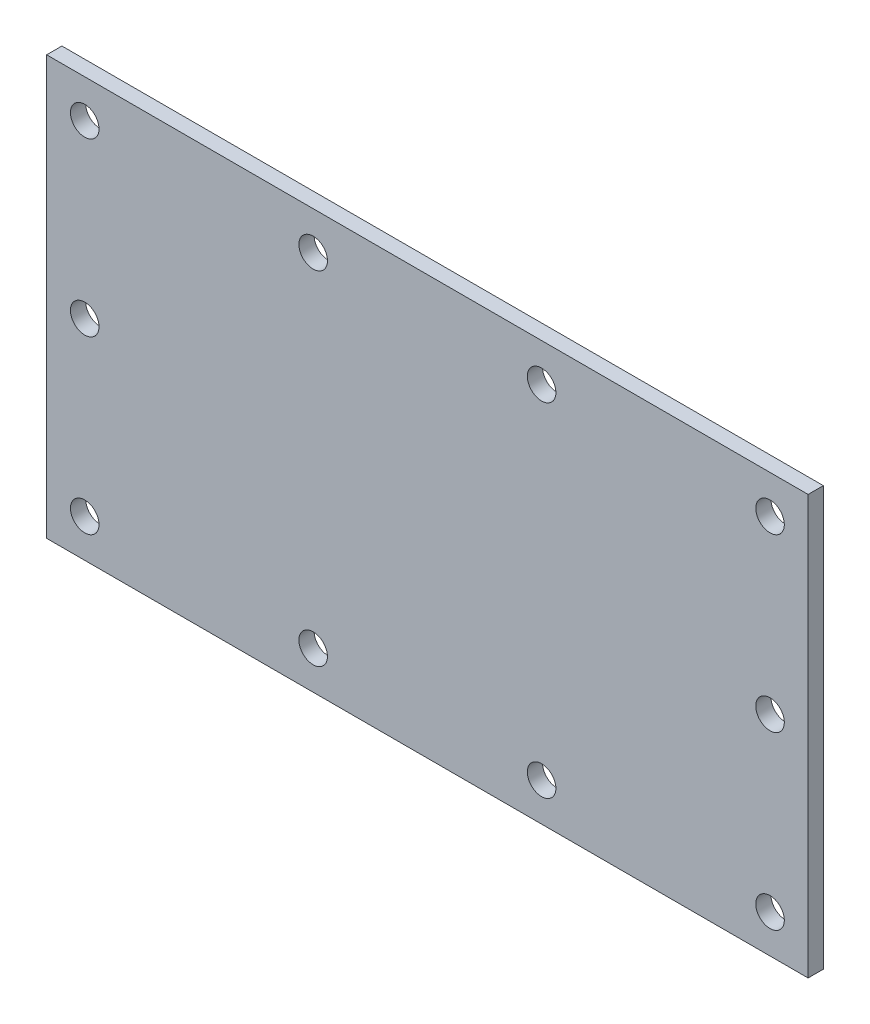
ISO-10303-21;
HEADER;
FILE_DESCRIPTION(('STEP AP214'),'2;1');
FILE_NAME('part.step','',(''),(''),'','','');
FILE_SCHEMA(('AUTOMOTIVE_DESIGN { 1 0 10303 214 1 1 1 1 }'));
ENDSEC;
DATA;
#1=APPLICATION_CONTEXT('core data for automotive mechanical design processes');
#2=APPLICATION_PROTOCOL_DEFINITION('international standard','automotive_design',2000,#1);
#3=PRODUCT_CONTEXT('',#1,'mechanical');
#4=PRODUCT('Part','Part','',(#3));
#5=PRODUCT_RELATED_PRODUCT_CATEGORY('part','',(#4));
#6=PRODUCT_DEFINITION_FORMATION('','',#4);
#7=PRODUCT_DEFINITION_CONTEXT('part definition',#1,'design');
#8=PRODUCT_DEFINITION('design','',#6,#7);
#9=PRODUCT_DEFINITION_SHAPE('','',#8);
#10=(LENGTH_UNIT() NAMED_UNIT(*) SI_UNIT(.MILLI.,.METRE.));
#11=(NAMED_UNIT(*) PLANE_ANGLE_UNIT() SI_UNIT($,.RADIAN.));
#12=(NAMED_UNIT(*) SI_UNIT($,.STERADIAN.) SOLID_ANGLE_UNIT());
#13=UNCERTAINTY_MEASURE_WITH_UNIT(LENGTH_MEASURE(1.E-05),#10,'distance_accuracy_value','');
#14=(GEOMETRIC_REPRESENTATION_CONTEXT(3) GLOBAL_UNCERTAINTY_ASSIGNED_CONTEXT((#13)) GLOBAL_UNIT_ASSIGNED_CONTEXT((#10,
#11,#12)) REPRESENTATION_CONTEXT('',''));
#15=CARTESIAN_POINT('',(0.,0.,0.));
#16=DIRECTION('',(0.,0.,1.));
#17=DIRECTION('',(1.,0.,0.));
#18=AXIS2_PLACEMENT_3D('',#15,#16,#17);
#19=CARTESIAN_POINT('',(0.,-220.,8.));
#20=DIRECTION('',(0.,0.,1.));
#21=DIRECTION('',(1.,0.,0.));
#22=AXIS2_PLACEMENT_3D('',#19,#20,#21);
#23=PLANE('',#22);
#24=CARTESIAN_POINT('',(140.,-20.,8.));
#25=DIRECTION('',(0.,0.,1.));
#26=DIRECTION('',(1.,0.,0.));
#27=AXIS2_PLACEMENT_3D('',#24,#25,#26);
#28=CIRCLE('',#27,7.50000000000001);
#29=CARTESIAN_POINT('',(147.5,-20.,8.));
#30=VERTEX_POINT('',#29);
#31=EDGE_CURVE('E139',#30,#30,#28,.T.);
#32=ORIENTED_EDGE('',*,*,#31,.F.);
#33=EDGE_LOOP('',(#32));
#34=FACE_BOUND('',#33,.T.);
#35=CARTESIAN_POINT('',(20.,-110.,8.));
#36=DIRECTION('',(0.,0.,1.));
#37=DIRECTION('',(1.,0.,0.));
#38=AXIS2_PLACEMENT_3D('',#35,#36,#37);
#39=CIRCLE('',#38,7.50000000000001);
#40=CARTESIAN_POINT('',(27.5,-110.,8.));
#41=VERTEX_POINT('',#40);
#42=EDGE_CURVE('E153',#41,#41,#39,.T.);
#43=ORIENTED_EDGE('',*,*,#42,.F.);
#44=EDGE_LOOP('',(#43));
#45=FACE_BOUND('',#44,.T.);
#46=CARTESIAN_POINT('',(140.,-200.,8.));
#47=DIRECTION('',(0.,0.,1.));
#48=DIRECTION('',(1.,0.,0.));
#49=AXIS2_PLACEMENT_3D('',#46,#47,#48);
#50=CIRCLE('',#49,7.50000000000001);
#51=CARTESIAN_POINT('',(147.5,-200.,8.));
#52=VERTEX_POINT('',#51);
#53=EDGE_CURVE('E163',#52,#52,#50,.T.);
#54=ORIENTED_EDGE('',*,*,#53,.F.);
#55=EDGE_LOOP('',(#54));
#56=FACE_BOUND('',#55,.T.);
#57=CARTESIAN_POINT('',(380.,-200.,8.));
#58=DIRECTION('',(0.,0.,1.));
#59=DIRECTION('',(1.,0.,0.));
#60=AXIS2_PLACEMENT_3D('',#57,#58,#59);
#61=CIRCLE('',#60,7.50000000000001);
#62=CARTESIAN_POINT('',(387.5,-200.,8.));
#63=VERTEX_POINT('',#62);
#64=EDGE_CURVE('E173',#63,#63,#61,.T.);
#65=ORIENTED_EDGE('',*,*,#64,.F.);
#66=EDGE_LOOP('',(#65));
#67=FACE_BOUND('',#66,.T.);
#68=CARTESIAN_POINT('',(380.,-20.,8.));
#69=DIRECTION('',(0.,0.,1.));
#70=DIRECTION('',(1.,0.,0.));
#71=AXIS2_PLACEMENT_3D('',#68,#69,#70);
#72=CIRCLE('',#71,7.50000000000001);
#73=CARTESIAN_POINT('',(387.5,-20.,8.));
#74=VERTEX_POINT('',#73);
#75=EDGE_CURVE('E89',#74,#74,#72,.T.);
#76=ORIENTED_EDGE('',*,*,#75,.F.);
#77=EDGE_LOOP('',(#76));
#78=FACE_BOUND('',#77,.T.);
#79=DIRECTION('',(0.,-1.,0.));
#80=VECTOR('',#79,1.);
#81=CARTESIAN_POINT('',(0.,0.,8.));
#82=LINE('',#81,#80);
#83=CARTESIAN_POINT('',(0.,0.,8.));
#84=VERTEX_POINT('',#83);
#85=CARTESIAN_POINT('',(0.,-220.,8.));
#86=VERTEX_POINT('',#85);
#87=EDGE_CURVE('E99',#84,#86,#82,.T.);
#88=ORIENTED_EDGE('',*,*,#87,.T.);
#89=DIRECTION('',(1.,0.,0.));
#90=VECTOR('',#89,1.);
#91=CARTESIAN_POINT('',(0.,-220.,8.));
#92=LINE('',#91,#90);
#93=CARTESIAN_POINT('',(400.,-220.,8.));
#94=VERTEX_POINT('',#93);
#95=EDGE_CURVE('E84',#86,#94,#92,.T.);
#96=ORIENTED_EDGE('',*,*,#95,.T.);
#97=DIRECTION('',(0.,1.,0.));
#98=VECTOR('',#97,1.);
#99=CARTESIAN_POINT('',(400.,0.,8.));
#100=LINE('',#99,#98);
#101=CARTESIAN_POINT('',(400.,0.,8.));
#102=VERTEX_POINT('',#101);
#103=EDGE_CURVE('E50',#94,#102,#100,.T.);
#104=ORIENTED_EDGE('',*,*,#103,.T.);
#105=DIRECTION('',(-1.,0.,0.));
#106=VECTOR('',#105,1.);
#107=CARTESIAN_POINT('',(0.,0.,8.));
#108=LINE('',#107,#106);
#109=EDGE_CURVE('E45',#102,#84,#108,.T.);
#110=ORIENTED_EDGE('',*,*,#109,.T.);
#111=EDGE_LOOP('',(#88,#96,#104,#110));
#112=FACE_BOUND('',#111,.T.);
#113=CARTESIAN_POINT('',(380.,-110.,8.));
#114=DIRECTION('',(0.,0.,1.));
#115=DIRECTION('',(1.,0.,0.));
#116=AXIS2_PLACEMENT_3D('',#113,#114,#115);
#117=CIRCLE('',#116,7.50000000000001);
#118=CARTESIAN_POINT('',(387.5,-110.,8.));
#119=VERTEX_POINT('',#118);
#120=EDGE_CURVE('E118',#119,#119,#117,.T.);
#121=ORIENTED_EDGE('',*,*,#120,.F.);
#122=EDGE_LOOP('',(#121));
#123=FACE_BOUND('',#122,.T.);
#124=CARTESIAN_POINT('',(260.,-200.,8.));
#125=DIRECTION('',(0.,0.,1.));
#126=DIRECTION('',(1.,0.,0.));
#127=AXIS2_PLACEMENT_3D('',#124,#125,#126);
#128=CIRCLE('',#127,7.50000000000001);
#129=CARTESIAN_POINT('',(267.5,-200.,8.));
#130=VERTEX_POINT('',#129);
#131=EDGE_CURVE('E122',#130,#130,#128,.T.);
#132=ORIENTED_EDGE('',*,*,#131,.F.);
#133=EDGE_LOOP('',(#132));
#134=FACE_BOUND('',#133,.T.);
#135=CARTESIAN_POINT('',(20.,-200.,8.));
#136=DIRECTION('',(0.,0.,1.));
#137=DIRECTION('',(1.,0.,0.));
#138=AXIS2_PLACEMENT_3D('',#135,#136,#137);
#139=CIRCLE('',#138,7.50000000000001);
#140=CARTESIAN_POINT('',(27.5,-200.,8.));
#141=VERTEX_POINT('',#140);
#142=EDGE_CURVE('E126',#141,#141,#139,.T.);
#143=ORIENTED_EDGE('',*,*,#142,.F.);
#144=EDGE_LOOP('',(#143));
#145=FACE_BOUND('',#144,.T.);
#146=CARTESIAN_POINT('',(20.,-20.,8.));
#147=DIRECTION('',(0.,0.,1.));
#148=DIRECTION('',(1.,0.,0.));
#149=AXIS2_PLACEMENT_3D('',#146,#147,#148);
#150=CIRCLE('',#149,7.5);
#151=CARTESIAN_POINT('',(27.5,-20.,8.));
#152=VERTEX_POINT('',#151);
#153=EDGE_CURVE('E130',#152,#152,#150,.T.);
#154=ORIENTED_EDGE('',*,*,#153,.F.);
#155=EDGE_LOOP('',(#154));
#156=FACE_BOUND('',#155,.T.);
#157=CARTESIAN_POINT('',(260.,-20.,8.));
#158=DIRECTION('',(0.,0.,1.));
#159=DIRECTION('',(1.,0.,0.));
#160=AXIS2_PLACEMENT_3D('',#157,#158,#159);
#161=CIRCLE('',#160,7.50000000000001);
#162=CARTESIAN_POINT('',(267.5,-20.,8.));
#163=VERTEX_POINT('',#162);
#164=EDGE_CURVE('E133',#163,#163,#161,.T.);
#165=ORIENTED_EDGE('',*,*,#164,.F.);
#166=EDGE_LOOP('',(#165));
#167=FACE_BOUND('',#166,.T.);
#168=ADVANCED_FACE('F30',(#34,#45,#56,#67,#78,#112,#123,#134,#145,#156,#167),#23,.T.);
#169=CARTESIAN_POINT('',(0.,-220.,0.));
#170=DIRECTION('',(0.,0.,1.));
#171=DIRECTION('',(1.,0.,0.));
#172=AXIS2_PLACEMENT_3D('',#169,#170,#171);
#173=PLANE('',#172);
#174=CARTESIAN_POINT('',(140.,-20.,0.));
#175=DIRECTION('',(0.,0.,1.));
#176=DIRECTION('',(1.,0.,0.));
#177=AXIS2_PLACEMENT_3D('',#174,#175,#176);
#178=CIRCLE('',#177,7.50000000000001);
#179=CARTESIAN_POINT('',(147.5,-20.,0.));
#180=VERTEX_POINT('',#179);
#181=EDGE_CURVE('E135',#180,#180,#178,.T.);
#182=ORIENTED_EDGE('',*,*,#181,.T.);
#183=EDGE_LOOP('',(#182));
#184=FACE_BOUND('',#183,.T.);
#185=CARTESIAN_POINT('',(20.,-110.,0.));
#186=DIRECTION('',(0.,0.,1.));
#187=DIRECTION('',(1.,0.,0.));
#188=AXIS2_PLACEMENT_3D('',#185,#186,#187);
#189=CIRCLE('',#188,7.50000000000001);
#190=CARTESIAN_POINT('',(27.5,-110.,0.));
#191=VERTEX_POINT('',#190);
#192=EDGE_CURVE('E150',#191,#191,#189,.T.);
#193=ORIENTED_EDGE('',*,*,#192,.T.);
#194=EDGE_LOOP('',(#193));
#195=FACE_BOUND('',#194,.T.);
#196=CARTESIAN_POINT('',(140.,-200.,0.));
#197=DIRECTION('',(0.,0.,1.));
#198=DIRECTION('',(1.,0.,0.));
#199=AXIS2_PLACEMENT_3D('',#196,#197,#198);
#200=CIRCLE('',#199,7.50000000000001);
#201=CARTESIAN_POINT('',(147.5,-200.,0.));
#202=VERTEX_POINT('',#201);
#203=EDGE_CURVE('E160',#202,#202,#200,.T.);
#204=ORIENTED_EDGE('',*,*,#203,.T.);
#205=EDGE_LOOP('',(#204));
#206=FACE_BOUND('',#205,.T.);
#207=CARTESIAN_POINT('',(380.,-200.,0.));
#208=DIRECTION('',(0.,0.,1.));
#209=DIRECTION('',(1.,0.,0.));
#210=AXIS2_PLACEMENT_3D('',#207,#208,#209);
#211=CIRCLE('',#210,7.50000000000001);
#212=CARTESIAN_POINT('',(387.5,-200.,0.));
#213=VERTEX_POINT('',#212);
#214=EDGE_CURVE('E170',#213,#213,#211,.T.);
#215=ORIENTED_EDGE('',*,*,#214,.T.);
#216=EDGE_LOOP('',(#215));
#217=FACE_BOUND('',#216,.T.);
#218=CARTESIAN_POINT('',(380.,-20.,0.));
#219=DIRECTION('',(0.,0.,1.));
#220=DIRECTION('',(1.,0.,0.));
#221=AXIS2_PLACEMENT_3D('',#218,#219,#220);
#222=CIRCLE('',#221,7.50000000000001);
#223=CARTESIAN_POINT('',(387.5,-20.,0.));
#224=VERTEX_POINT('',#223);
#225=EDGE_CURVE('E92',#224,#224,#222,.T.);
#226=ORIENTED_EDGE('',*,*,#225,.T.);
#227=EDGE_LOOP('',(#226));
#228=FACE_BOUND('',#227,.T.);
#229=DIRECTION('',(0.,-1.,0.));
#230=VECTOR('',#229,1.);
#231=CARTESIAN_POINT('',(0.,0.,0.));
#232=LINE('',#231,#230);
#233=CARTESIAN_POINT('',(0.,0.,0.));
#234=VERTEX_POINT('',#233);
#235=CARTESIAN_POINT('',(0.,-220.,0.));
#236=VERTEX_POINT('',#235);
#237=EDGE_CURVE('E76',#234,#236,#232,.T.);
#238=ORIENTED_EDGE('',*,*,#237,.F.);
#239=DIRECTION('',(-1.,0.,0.));
#240=VECTOR('',#239,1.);
#241=CARTESIAN_POINT('',(0.,0.,0.));
#242=LINE('',#241,#240);
#243=CARTESIAN_POINT('',(400.,0.,0.));
#244=VERTEX_POINT('',#243);
#245=EDGE_CURVE('E97',#244,#234,#242,.T.);
#246=ORIENTED_EDGE('',*,*,#245,.F.);
#247=DIRECTION('',(0.,1.,0.));
#248=VECTOR('',#247,1.);
#249=CARTESIAN_POINT('',(400.,0.,0.));
#250=LINE('',#249,#248);
#251=CARTESIAN_POINT('',(400.,-220.,0.));
#252=VERTEX_POINT('',#251);
#253=EDGE_CURVE('E77',#252,#244,#250,.T.);
#254=ORIENTED_EDGE('',*,*,#253,.F.);
#255=DIRECTION('',(1.,0.,0.));
#256=VECTOR('',#255,1.);
#257=CARTESIAN_POINT('',(0.,-220.,0.));
#258=LINE('',#257,#256);
#259=EDGE_CURVE('E71',#236,#252,#258,.T.);
#260=ORIENTED_EDGE('',*,*,#259,.F.);
#261=EDGE_LOOP('',(#238,#246,#254,#260));
#262=FACE_BOUND('',#261,.T.);
#263=CARTESIAN_POINT('',(380.,-110.,0.));
#264=DIRECTION('',(0.,0.,1.));
#265=DIRECTION('',(1.,0.,0.));
#266=AXIS2_PLACEMENT_3D('',#263,#264,#265);
#267=CIRCLE('',#266,7.50000000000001);
#268=CARTESIAN_POINT('',(387.5,-110.,0.));
#269=VERTEX_POINT('',#268);
#270=EDGE_CURVE('E176',#269,#269,#267,.T.);
#271=ORIENTED_EDGE('',*,*,#270,.T.);
#272=EDGE_LOOP('',(#271));
#273=FACE_BOUND('',#272,.T.);
#274=CARTESIAN_POINT('',(260.,-200.,0.));
#275=DIRECTION('',(0.,0.,1.));
#276=DIRECTION('',(1.,0.,0.));
#277=AXIS2_PLACEMENT_3D('',#274,#275,#276);
#278=CIRCLE('',#277,7.50000000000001);
#279=CARTESIAN_POINT('',(267.5,-200.,0.));
#280=VERTEX_POINT('',#279);
#281=EDGE_CURVE('E166',#280,#280,#278,.T.);
#282=ORIENTED_EDGE('',*,*,#281,.T.);
#283=EDGE_LOOP('',(#282));
#284=FACE_BOUND('',#283,.T.);
#285=CARTESIAN_POINT('',(20.,-200.,0.));
#286=DIRECTION('',(0.,0.,1.));
#287=DIRECTION('',(1.,0.,0.));
#288=AXIS2_PLACEMENT_3D('',#285,#286,#287);
#289=CIRCLE('',#288,7.50000000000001);
#290=CARTESIAN_POINT('',(27.5,-200.,0.));
#291=VERTEX_POINT('',#290);
#292=EDGE_CURVE('E156',#291,#291,#289,.T.);
#293=ORIENTED_EDGE('',*,*,#292,.T.);
#294=EDGE_LOOP('',(#293));
#295=FACE_BOUND('',#294,.T.);
#296=CARTESIAN_POINT('',(20.,-20.,0.));
#297=DIRECTION('',(0.,0.,1.));
#298=DIRECTION('',(1.,0.,0.));
#299=AXIS2_PLACEMENT_3D('',#296,#297,#298);
#300=CIRCLE('',#299,7.5);
#301=CARTESIAN_POINT('',(27.5,-20.,0.));
#302=VERTEX_POINT('',#301);
#303=EDGE_CURVE('E146',#302,#302,#300,.T.);
#304=ORIENTED_EDGE('',*,*,#303,.T.);
#305=EDGE_LOOP('',(#304));
#306=FACE_BOUND('',#305,.T.);
#307=CARTESIAN_POINT('',(260.,-20.,0.));
#308=DIRECTION('',(0.,0.,1.));
#309=DIRECTION('',(1.,0.,0.));
#310=AXIS2_PLACEMENT_3D('',#307,#308,#309);
#311=CIRCLE('',#310,7.50000000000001);
#312=CARTESIAN_POINT('',(267.5,-20.,0.));
#313=VERTEX_POINT('',#312);
#314=EDGE_CURVE('E136',#313,#313,#311,.T.);
#315=ORIENTED_EDGE('',*,*,#314,.T.);
#316=EDGE_LOOP('',(#315));
#317=FACE_BOUND('',#316,.T.);
#318=ADVANCED_FACE('F72',(#184,#195,#206,#217,#228,#262,#273,#284,#295,#306,#317),#173,.F.);
#319=CARTESIAN_POINT('',(0.,0.,8.));
#320=DIRECTION('',(1.,0.,0.));
#321=DIRECTION('',(0.,1.,0.));
#322=AXIS2_PLACEMENT_3D('',#319,#320,#321);
#323=PLANE('',#322);
#324=ORIENTED_EDGE('',*,*,#237,.T.);
#325=DIRECTION('',(0.,0.,-1.));
#326=VECTOR('',#325,1.);
#327=CARTESIAN_POINT('',(0.,-220.,8.));
#328=LINE('',#327,#326);
#329=EDGE_CURVE('E11',#86,#236,#328,.T.);
#330=ORIENTED_EDGE('',*,*,#329,.F.);
#331=ORIENTED_EDGE('',*,*,#87,.F.);
#332=DIRECTION('',(0.,0.,-1.));
#333=VECTOR('',#332,1.);
#334=CARTESIAN_POINT('',(0.,0.,8.));
#335=LINE('',#334,#333);
#336=EDGE_CURVE('E88',#84,#234,#335,.T.);
#337=ORIENTED_EDGE('',*,*,#336,.T.);
#338=EDGE_LOOP('',(#324,#330,#331,#337));
#339=FACE_BOUND('',#338,.T.);
#340=ADVANCED_FACE('F32',(#339),#323,.F.);
#341=CARTESIAN_POINT('',(0.,-220.,8.));
#342=DIRECTION('',(0.,1.,0.));
#343=DIRECTION('',(0.,0.,1.));
#344=AXIS2_PLACEMENT_3D('',#341,#342,#343);
#345=PLANE('',#344);
#346=ORIENTED_EDGE('',*,*,#259,.T.);
#347=DIRECTION('',(0.,0.,-1.));
#348=VECTOR('',#347,1.);
#349=CARTESIAN_POINT('',(400.,-220.,8.));
#350=LINE('',#349,#348);
#351=EDGE_CURVE('E38',#94,#252,#350,.T.);
#352=ORIENTED_EDGE('',*,*,#351,.F.);
#353=ORIENTED_EDGE('',*,*,#95,.F.);
#354=ORIENTED_EDGE('',*,*,#329,.T.);
#355=EDGE_LOOP('',(#346,#352,#353,#354));
#356=FACE_BOUND('',#355,.T.);
#357=ADVANCED_FACE('F83',(#356),#345,.F.);
#358=CARTESIAN_POINT('',(400.,0.,8.));
#359=DIRECTION('',(-1.,0.,0.));
#360=DIRECTION('',(0.,0.,1.));
#361=AXIS2_PLACEMENT_3D('',#358,#359,#360);
#362=PLANE('',#361);
#363=ORIENTED_EDGE('',*,*,#253,.T.);
#364=DIRECTION('',(0.,0.,-1.));
#365=VECTOR('',#364,1.);
#366=CARTESIAN_POINT('',(400.,0.,8.));
#367=LINE('',#366,#365);
#368=EDGE_CURVE('E105',#102,#244,#367,.T.);
#369=ORIENTED_EDGE('',*,*,#368,.F.);
#370=ORIENTED_EDGE('',*,*,#103,.F.);
#371=ORIENTED_EDGE('',*,*,#351,.T.);
#372=EDGE_LOOP('',(#363,#369,#370,#371));
#373=FACE_BOUND('',#372,.T.);
#374=ADVANCED_FACE('F108',(#373),#362,.F.);
#375=CARTESIAN_POINT('',(0.,0.,8.));
#376=DIRECTION('',(0.,-1.,0.));
#377=DIRECTION('',(0.,0.,-1.));
#378=AXIS2_PLACEMENT_3D('',#375,#376,#377);
#379=PLANE('',#378);
#380=ORIENTED_EDGE('',*,*,#245,.T.);
#381=ORIENTED_EDGE('',*,*,#336,.F.);
#382=ORIENTED_EDGE('',*,*,#109,.F.);
#383=ORIENTED_EDGE('',*,*,#368,.T.);
#384=EDGE_LOOP('',(#380,#381,#382,#383));
#385=FACE_BOUND('',#384,.T.);
#386=ADVANCED_FACE('F110',(#385),#379,.F.);
#387=CARTESIAN_POINT('',(380.,-20.,8.));
#388=DIRECTION('',(0.,0.,-1.));
#389=DIRECTION('',(-1.,0.,0.));
#390=AXIS2_PLACEMENT_3D('',#387,#388,#389);
#391=CYLINDRICAL_SURFACE('',#390,7.50000000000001);
#392=ORIENTED_EDGE('',*,*,#75,.T.);
#393=EDGE_LOOP('',(#392));
#394=FACE_BOUND('',#393,.T.);
#395=ORIENTED_EDGE('',*,*,#225,.F.);
#396=EDGE_LOOP('',(#395));
#397=FACE_BOUND('',#396,.T.);
#398=ADVANCED_FACE('F183',(#394,#397),#391,.F.);
#399=CARTESIAN_POINT('',(380.,-110.,8.));
#400=DIRECTION('',(0.,0.,-1.));
#401=DIRECTION('',(-1.,0.,0.));
#402=AXIS2_PLACEMENT_3D('',#399,#400,#401);
#403=CYLINDRICAL_SURFACE('',#402,7.50000000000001);
#404=ORIENTED_EDGE('',*,*,#120,.T.);
#405=EDGE_LOOP('',(#404));
#406=FACE_BOUND('',#405,.T.);
#407=ORIENTED_EDGE('',*,*,#270,.F.);
#408=EDGE_LOOP('',(#407));
#409=FACE_BOUND('',#408,.T.);
#410=ADVANCED_FACE('F185',(#406,#409),#403,.F.);
#411=CARTESIAN_POINT('',(380.,-200.,8.));
#412=DIRECTION('',(0.,0.,-1.));
#413=DIRECTION('',(-1.,0.,0.));
#414=AXIS2_PLACEMENT_3D('',#411,#412,#413);
#415=CYLINDRICAL_SURFACE('',#414,7.50000000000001);
#416=ORIENTED_EDGE('',*,*,#64,.T.);
#417=EDGE_LOOP('',(#416));
#418=FACE_BOUND('',#417,.T.);
#419=ORIENTED_EDGE('',*,*,#214,.F.);
#420=EDGE_LOOP('',(#419));
#421=FACE_BOUND('',#420,.T.);
#422=ADVANCED_FACE('F192',(#418,#421),#415,.F.);
#423=CARTESIAN_POINT('',(260.,-200.,8.));
#424=DIRECTION('',(0.,0.,-1.));
#425=DIRECTION('',(-1.,0.,0.));
#426=AXIS2_PLACEMENT_3D('',#423,#424,#425);
#427=CYLINDRICAL_SURFACE('',#426,7.50000000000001);
#428=ORIENTED_EDGE('',*,*,#131,.T.);
#429=EDGE_LOOP('',(#428));
#430=FACE_BOUND('',#429,.T.);
#431=ORIENTED_EDGE('',*,*,#281,.F.);
#432=EDGE_LOOP('',(#431));
#433=FACE_BOUND('',#432,.T.);
#434=ADVANCED_FACE('F253',(#430,#433),#427,.F.);
#435=CARTESIAN_POINT('',(140.,-200.,8.));
#436=DIRECTION('',(0.,0.,-1.));
#437=DIRECTION('',(-1.,0.,0.));
#438=AXIS2_PLACEMENT_3D('',#435,#436,#437);
#439=CYLINDRICAL_SURFACE('',#438,7.50000000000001);
#440=ORIENTED_EDGE('',*,*,#53,.T.);
#441=EDGE_LOOP('',(#440));
#442=FACE_BOUND('',#441,.T.);
#443=ORIENTED_EDGE('',*,*,#203,.F.);
#444=EDGE_LOOP('',(#443));
#445=FACE_BOUND('',#444,.T.);
#446=ADVANCED_FACE('F261',(#442,#445),#439,.F.);
#447=CARTESIAN_POINT('',(20.,-200.,8.));
#448=DIRECTION('',(0.,0.,-1.));
#449=DIRECTION('',(-1.,0.,0.));
#450=AXIS2_PLACEMENT_3D('',#447,#448,#449);
#451=CYLINDRICAL_SURFACE('',#450,7.50000000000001);
#452=ORIENTED_EDGE('',*,*,#142,.T.);
#453=EDGE_LOOP('',(#452));
#454=FACE_BOUND('',#453,.T.);
#455=ORIENTED_EDGE('',*,*,#292,.F.);
#456=EDGE_LOOP('',(#455));
#457=FACE_BOUND('',#456,.T.);
#458=ADVANCED_FACE('F270',(#454,#457),#451,.F.);
#459=CARTESIAN_POINT('',(20.,-110.,8.));
#460=DIRECTION('',(0.,0.,-1.));
#461=DIRECTION('',(-1.,0.,0.));
#462=AXIS2_PLACEMENT_3D('',#459,#460,#461);
#463=CYLINDRICAL_SURFACE('',#462,7.50000000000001);
#464=ORIENTED_EDGE('',*,*,#42,.T.);
#465=EDGE_LOOP('',(#464));
#466=FACE_BOUND('',#465,.T.);
#467=ORIENTED_EDGE('',*,*,#192,.F.);
#468=EDGE_LOOP('',(#467));
#469=FACE_BOUND('',#468,.T.);
#470=ADVANCED_FACE('F279',(#466,#469),#463,.F.);
#471=CARTESIAN_POINT('',(20.,-20.,8.));
#472=DIRECTION('',(0.,0.,-1.));
#473=DIRECTION('',(-1.,0.,0.));
#474=AXIS2_PLACEMENT_3D('',#471,#472,#473);
#475=CYLINDRICAL_SURFACE('',#474,7.5);
#476=ORIENTED_EDGE('',*,*,#153,.T.);
#477=EDGE_LOOP('',(#476));
#478=FACE_BOUND('',#477,.T.);
#479=ORIENTED_EDGE('',*,*,#303,.F.);
#480=EDGE_LOOP('',(#479));
#481=FACE_BOUND('',#480,.T.);
#482=ADVANCED_FACE('F288',(#478,#481),#475,.F.);
#483=CARTESIAN_POINT('',(140.,-20.,8.));
#484=DIRECTION('',(0.,0.,-1.));
#485=DIRECTION('',(-1.,0.,0.));
#486=AXIS2_PLACEMENT_3D('',#483,#484,#485);
#487=CYLINDRICAL_SURFACE('',#486,7.50000000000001);
#488=ORIENTED_EDGE('',*,*,#31,.T.);
#489=EDGE_LOOP('',(#488));
#490=FACE_BOUND('',#489,.T.);
#491=ORIENTED_EDGE('',*,*,#181,.F.);
#492=EDGE_LOOP('',(#491));
#493=FACE_BOUND('',#492,.T.);
#494=ADVANCED_FACE('F297',(#490,#493),#487,.F.);
#495=CARTESIAN_POINT('',(260.,-20.,8.));
#496=DIRECTION('',(0.,0.,-1.));
#497=DIRECTION('',(-1.,0.,0.));
#498=AXIS2_PLACEMENT_3D('',#495,#496,#497);
#499=CYLINDRICAL_SURFACE('',#498,7.50000000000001);
#500=ORIENTED_EDGE('',*,*,#164,.T.);
#501=EDGE_LOOP('',(#500));
#502=FACE_BOUND('',#501,.T.);
#503=ORIENTED_EDGE('',*,*,#314,.F.);
#504=EDGE_LOOP('',(#503));
#505=FACE_BOUND('',#504,.T.);
#506=ADVANCED_FACE('F306',(#502,#505),#499,.F.);
#507=CLOSED_SHELL('',(#168,#318,#340,#357,#374,#386,#398,#410,#422,#434,#446,#458,#470,#482,
#494,#506));
#508=MANIFOLD_SOLID_BREP('B2',#507);
#509=ADVANCED_BREP_SHAPE_REPRESENTATION('',(#18,#508),#14);
#510=SHAPE_DEFINITION_REPRESENTATION(#9,#509);
ENDSEC;
END-ISO-10303-21;
